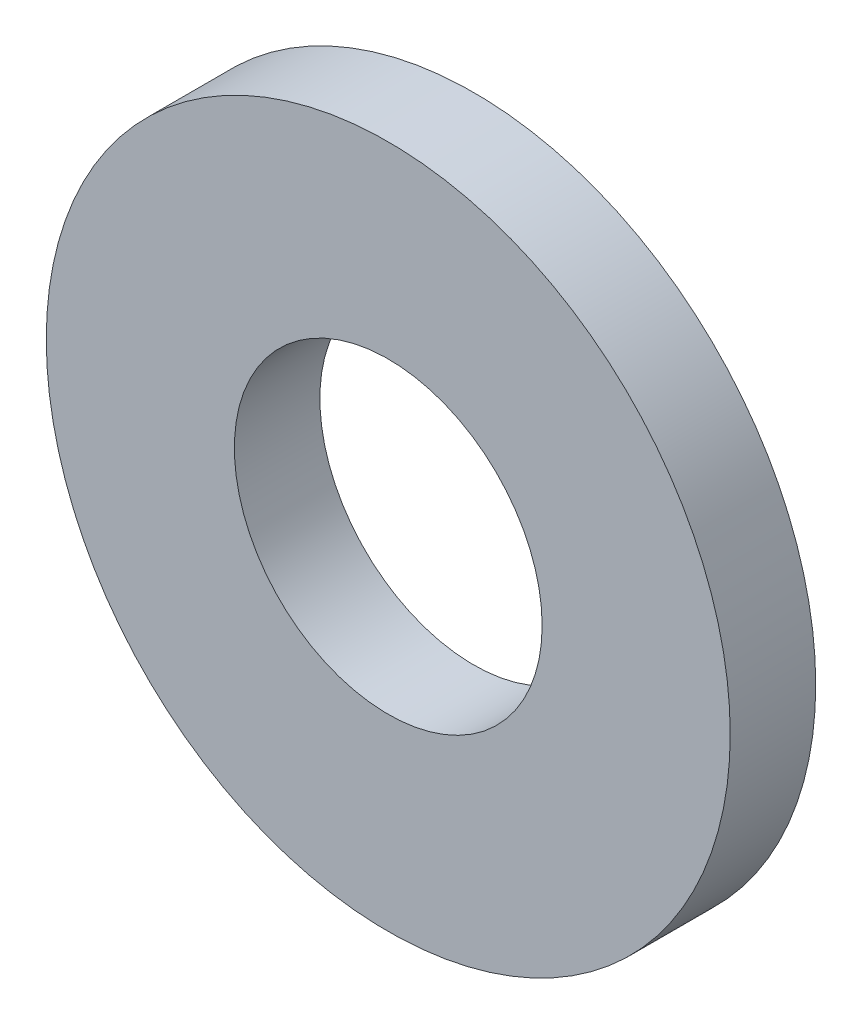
from build123d import *

# Parameters (mm, degrees)
ESQUISSE1_R      = 10
ESQUISSE1_R_2    = 4.5
EXTRUSION1_DEPTH = 2.5


with BuildPart() as part:
    # Esquisse1 → Extrusion1 (new body)
    with BuildSketch(Plane.XY):
        Circle(ESQUISSE1_R)
        Circle(ESQUISSE1_R_2, mode=Mode.SUBTRACT)
    extrude(amount=EXTRUSION1_DEPTH)


solid = part.part
